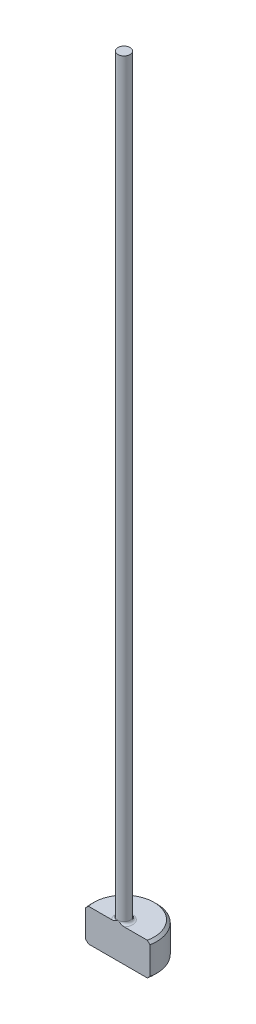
from build123d import *

# Parameters (mm, degrees)
CHAMFER1_SIZE = 0.254
FILLET1_R     = 0.254
KEY_DEPTH     = 77.332177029


with BuildPart() as part:
    # Sketch1 → Revolve1 (revolve)
    with BuildSketch(Plane.XY, mode=Mode.PRIVATE) as revolve1_sk:
        Polygon((0, 0), (-3.175, 0), (-3.175, 3.175), (-0.59436, 3.175), (-0.59436, 76.2), (0, 76.2), align=None)
    revolve(revolve1_sk.sketch.rotate(Axis((0, 259.958771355, 0), (0, -1, 0)), 270), axis=Axis((0, 259.958771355, 0), (0, -1, 0)))

    # Chamfer1
    chamfer1_edges = [part.edges().sort_by_distance(p)[0] for p in [
        (0, 3.175, -3.175),
        (0, 0, -3.175),
    ]]
    chamfer(chamfer1_edges, length=CHAMFER1_SIZE)

    # Fillet1
    fillet1_edges = [part.edges().sort_by_distance(p)[0] for p in [
        (0, 3.175, -0.59436),
    ]]
    fillet(fillet1_edges, radius=FILLET1_R)

    # Sketch2 → Key (cut, through all)
    with BuildSketch(Plane(origin=(0, 0, 0), x_dir=(1, 0, 0), z_dir=(0, 1, 0))):
        with BuildLine():
            Line((-3.118871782, -0.59436), (3.118871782, -0.59436))
            ThreePointArc((3.118871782, -0.59436), (0, -3.175), (-3.118871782, -0.59436))
        make_face()
    extrude(amount=KEY_DEPTH, mode=Mode.SUBTRACT)


solid = part.part
